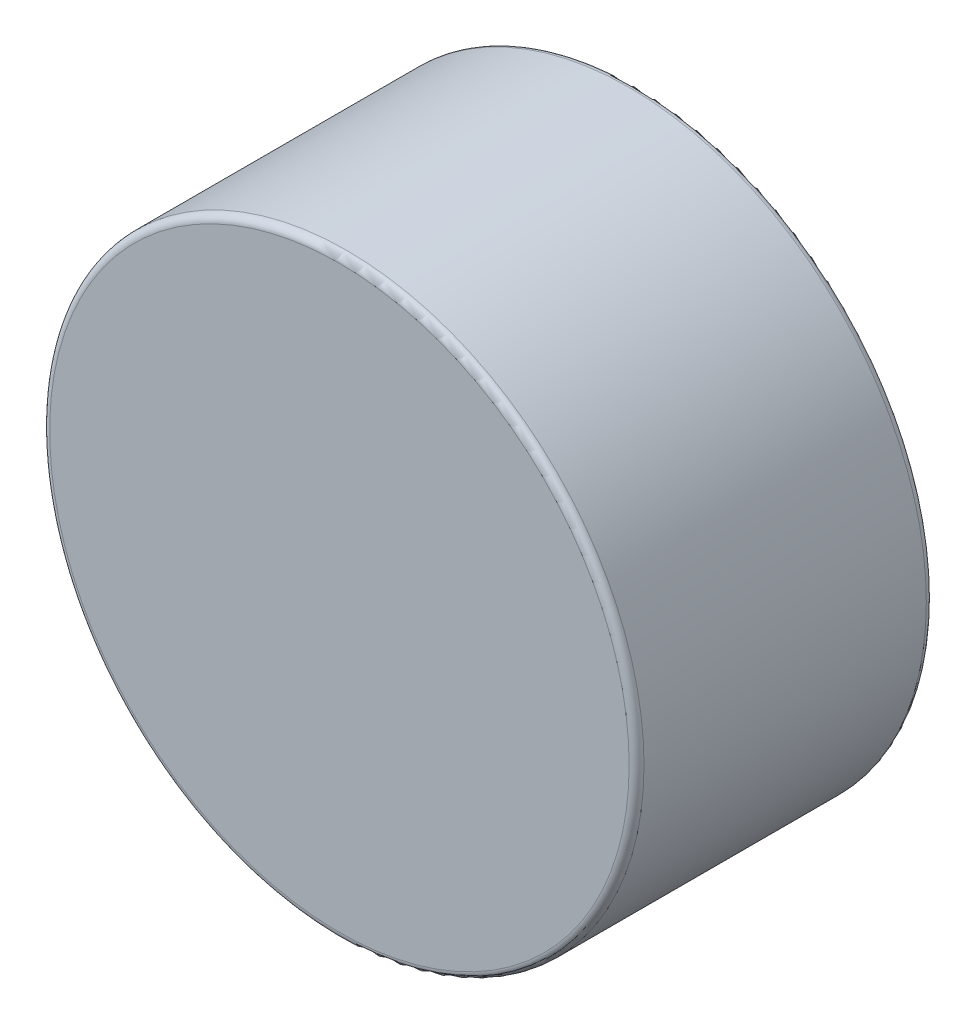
from build123d import *

# Parameters (mm, degrees)
ESQUISSE1_R          = 4
BASE_EXTRUSION_DEPTH = 4
CONG_1_R             = 0.1


with BuildPart() as part:
    # Esquisse1 → Base-Extrusion (new body)
    with BuildSketch(Plane.XY):
        Circle(ESQUISSE1_R)
    extrude(amount=BASE_EXTRUSION_DEPTH)

    # Cong_1
    cong_1_edges = [part.edges().sort_by_distance(p)[0] for p in [
        (-4, 0, 0),
        (-4, 0, 4),
    ]]
    fillet(cong_1_edges, radius=CONG_1_R)


solid = part.part
